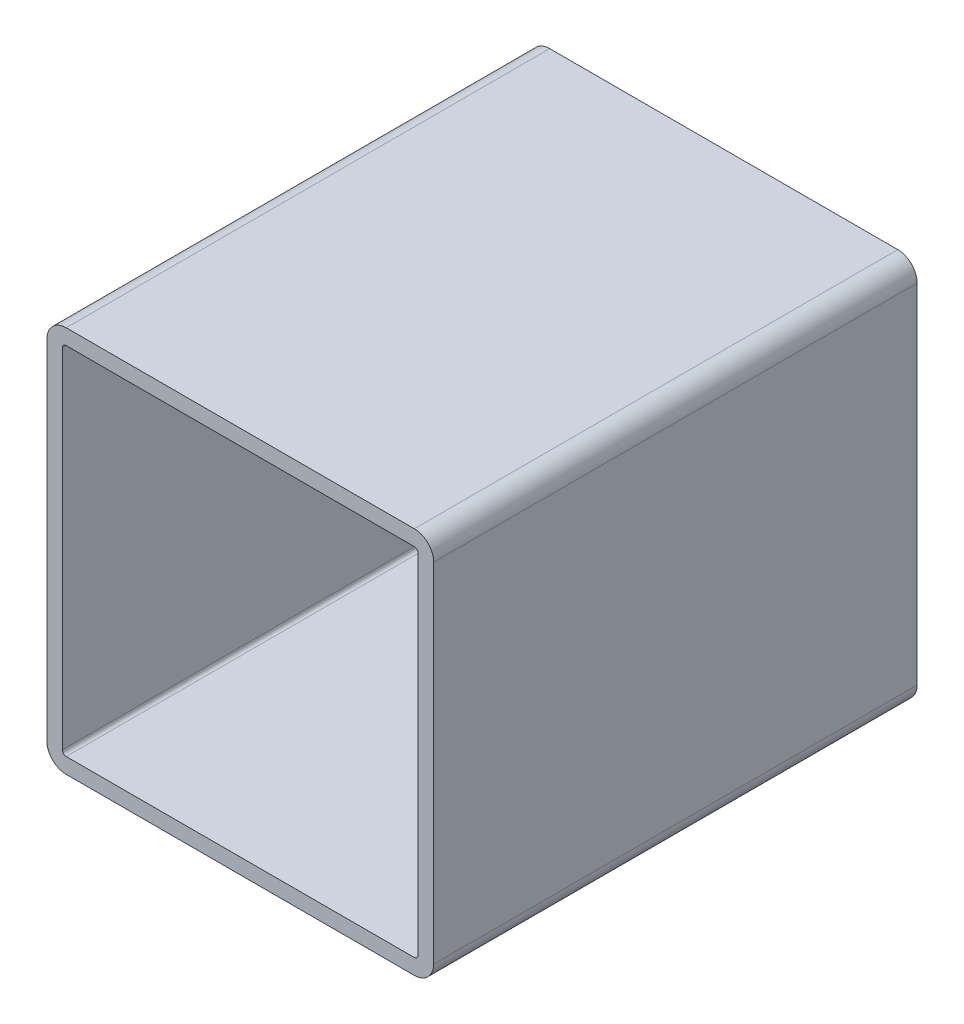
ISO-10303-21;
HEADER;
FILE_DESCRIPTION(('STEP AP214'),'2;1');
FILE_NAME('part.step','',(''),(''),'','','');
FILE_SCHEMA(('AUTOMOTIVE_DESIGN { 1 0 10303 214 1 1 1 1 }'));
ENDSEC;
DATA;
#1=APPLICATION_CONTEXT('core data for automotive mechanical design processes');
#2=APPLICATION_PROTOCOL_DEFINITION('international standard','automotive_design',2000,#1);
#3=PRODUCT_CONTEXT('',#1,'mechanical');
#4=PRODUCT('Part','Part','',(#3));
#5=PRODUCT_RELATED_PRODUCT_CATEGORY('part','',(#4));
#6=PRODUCT_DEFINITION_FORMATION('','',#4);
#7=PRODUCT_DEFINITION_CONTEXT('part definition',#1,'design');
#8=PRODUCT_DEFINITION('design','',#6,#7);
#9=PRODUCT_DEFINITION_SHAPE('','',#8);
#10=(LENGTH_UNIT() NAMED_UNIT(*) SI_UNIT(.MILLI.,.METRE.));
#11=(NAMED_UNIT(*) PLANE_ANGLE_UNIT() SI_UNIT($,.RADIAN.));
#12=(NAMED_UNIT(*) SI_UNIT($,.STERADIAN.) SOLID_ANGLE_UNIT());
#13=UNCERTAINTY_MEASURE_WITH_UNIT(LENGTH_MEASURE(1.E-05),#10,'distance_accuracy_value','');
#14=(GEOMETRIC_REPRESENTATION_CONTEXT(3) GLOBAL_UNCERTAINTY_ASSIGNED_CONTEXT((#13)) GLOBAL_UNIT_ASSIGNED_CONTEXT((#10,
#11,#12)) REPRESENTATION_CONTEXT('',''));
#15=CARTESIAN_POINT('',(0.,0.,0.));
#16=DIRECTION('',(0.,0.,1.));
#17=DIRECTION('',(1.,0.,0.));
#18=AXIS2_PLACEMENT_3D('',#15,#16,#17);
#19=CARTESIAN_POINT('',(95.,-5.,125.));
#20=DIRECTION('',(0.,0.,1.));
#21=DIRECTION('',(1.,0.,0.));
#22=AXIS2_PLACEMENT_3D('',#19,#20,#21);
#23=PLANE('',#22);
#24=CARTESIAN_POINT('',(95.,-5.,125.));
#25=DIRECTION('',(0.,0.,1.));
#26=DIRECTION('',(1.,0.,0.));
#27=AXIS2_PLACEMENT_3D('',#24,#25,#26);
#28=CIRCLE('',#27,5.);
#29=CARTESIAN_POINT('',(100.,-5.00000000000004,125.));
#30=VERTEX_POINT('',#29);
#31=CARTESIAN_POINT('',(95.,0.,125.));
#32=VERTEX_POINT('',#31);
#33=EDGE_CURVE('E227',#30,#32,#28,.T.);
#34=ORIENTED_EDGE('',*,*,#33,.T.);
#35=DIRECTION('',(-1.,0.,0.));
#36=VECTOR('',#35,1.);
#37=CARTESIAN_POINT('',(5.00000000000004,0.,125.));
#38=LINE('',#37,#36);
#39=CARTESIAN_POINT('',(5.00000000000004,0.,125.));
#40=VERTEX_POINT('',#39);
#41=EDGE_CURVE('E230',#32,#40,#38,.T.);
#42=ORIENTED_EDGE('',*,*,#41,.T.);
#43=CARTESIAN_POINT('',(5.,-5.,125.));
#44=DIRECTION('',(0.,0.,1.));
#45=DIRECTION('',(1.,0.,0.));
#46=AXIS2_PLACEMENT_3D('',#43,#44,#45);
#47=CIRCLE('',#46,5.);
#48=CARTESIAN_POINT('',(0.,-5.00000000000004,125.));
#49=VERTEX_POINT('',#48);
#50=EDGE_CURVE('E232',#40,#49,#47,.T.);
#51=ORIENTED_EDGE('',*,*,#50,.T.);
#52=DIRECTION('',(0.,-1.,0.));
#53=VECTOR('',#52,1.);
#54=CARTESIAN_POINT('',(0.,-5.00000000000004,125.));
#55=LINE('',#54,#53);
#56=CARTESIAN_POINT('',(0.,-95.,125.));
#57=VERTEX_POINT('',#56);
#58=EDGE_CURVE('E234',#49,#57,#55,.T.);
#59=ORIENTED_EDGE('',*,*,#58,.T.);
#60=CARTESIAN_POINT('',(5.00000000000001,-95.,125.));
#61=DIRECTION('',(0.,0.,1.));
#62=DIRECTION('',(1.,0.,0.));
#63=AXIS2_PLACEMENT_3D('',#60,#61,#62);
#64=CIRCLE('',#63,5.);
#65=CARTESIAN_POINT('',(5.00000000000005,-100.,125.));
#66=VERTEX_POINT('',#65);
#67=EDGE_CURVE('E236',#57,#66,#64,.T.);
#68=ORIENTED_EDGE('',*,*,#67,.T.);
#69=DIRECTION('',(1.,0.,0.));
#70=VECTOR('',#69,1.);
#71=CARTESIAN_POINT('',(5.00000000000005,-100.,125.));
#72=LINE('',#71,#70);
#73=CARTESIAN_POINT('',(95.,-100.,125.));
#74=VERTEX_POINT('',#73);
#75=EDGE_CURVE('E238',#66,#74,#72,.T.);
#76=ORIENTED_EDGE('',*,*,#75,.T.);
#77=CARTESIAN_POINT('',(95.,-95.,125.));
#78=DIRECTION('',(0.,0.,1.));
#79=DIRECTION('',(-1.,0.,0.));
#80=AXIS2_PLACEMENT_3D('',#77,#78,#79);
#81=CIRCLE('',#80,5.);
#82=CARTESIAN_POINT('',(100.,-95.,125.));
#83=VERTEX_POINT('',#82);
#84=EDGE_CURVE('E240',#74,#83,#81,.T.);
#85=ORIENTED_EDGE('',*,*,#84,.T.);
#86=DIRECTION('',(0.,1.,0.));
#87=VECTOR('',#86,1.);
#88=CARTESIAN_POINT('',(100.,-5.00000000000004,125.));
#89=LINE('',#88,#87);
#90=EDGE_CURVE('E242',#83,#30,#89,.T.);
#91=ORIENTED_EDGE('',*,*,#90,.T.);
#92=EDGE_LOOP('',(#34,#42,#51,#59,#68,#76,#85,#91));
#93=FACE_BOUND('',#92,.T.);
#94=DIRECTION('',(0.,-1.,0.));
#95=VECTOR('',#94,1.);
#96=CARTESIAN_POINT('',(4.,-5.00000000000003,125.));
#97=LINE('',#96,#95);
#98=CARTESIAN_POINT('',(4.,-5.00000000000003,125.));
#99=VERTEX_POINT('',#98);
#100=CARTESIAN_POINT('',(4.00000000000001,-95.,125.));
#101=VERTEX_POINT('',#100);
#102=EDGE_CURVE('E184',#99,#101,#97,.T.);
#103=ORIENTED_EDGE('',*,*,#102,.F.);
#104=CARTESIAN_POINT('',(5.,-5.,125.));
#105=DIRECTION('',(0.,0.,1.));
#106=DIRECTION('',(1.,0.,0.));
#107=AXIS2_PLACEMENT_3D('',#104,#105,#106);
#108=CIRCLE('',#107,0.999999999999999);
#109=CARTESIAN_POINT('',(5.00000000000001,-4.,125.));
#110=VERTEX_POINT('',#109);
#111=EDGE_CURVE('E161',#110,#99,#108,.T.);
#112=ORIENTED_EDGE('',*,*,#111,.F.);
#113=DIRECTION('',(-1.,0.,0.));
#114=VECTOR('',#113,1.);
#115=CARTESIAN_POINT('',(5.00000000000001,-4.,125.));
#116=LINE('',#115,#114);
#117=CARTESIAN_POINT('',(95.,-4.,125.));
#118=VERTEX_POINT('',#117);
#119=EDGE_CURVE('E196',#118,#110,#116,.T.);
#120=ORIENTED_EDGE('',*,*,#119,.F.);
#121=CARTESIAN_POINT('',(95.,-5.,125.));
#122=DIRECTION('',(0.,0.,1.));
#123=DIRECTION('',(1.,0.,0.));
#124=AXIS2_PLACEMENT_3D('',#121,#122,#123);
#125=CIRCLE('',#124,1.);
#126=CARTESIAN_POINT('',(96.,-5.00000000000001,125.));
#127=VERTEX_POINT('',#126);
#128=EDGE_CURVE('E194',#127,#118,#125,.T.);
#129=ORIENTED_EDGE('',*,*,#128,.F.);
#130=DIRECTION('',(0.,1.,0.));
#131=VECTOR('',#130,1.);
#132=CARTESIAN_POINT('',(96.,-5.00000000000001,125.));
#133=LINE('',#132,#131);
#134=CARTESIAN_POINT('',(96.,-95.,125.));
#135=VERTEX_POINT('',#134);
#136=EDGE_CURVE('E192',#135,#127,#133,.T.);
#137=ORIENTED_EDGE('',*,*,#136,.F.);
#138=CARTESIAN_POINT('',(95.,-95.,125.));
#139=DIRECTION('',(0.,0.,1.));
#140=DIRECTION('',(-1.,0.,0.));
#141=AXIS2_PLACEMENT_3D('',#138,#139,#140);
#142=CIRCLE('',#141,1.);
#143=CARTESIAN_POINT('',(95.,-96.,125.));
#144=VERTEX_POINT('',#143);
#145=EDGE_CURVE('E190',#144,#135,#142,.T.);
#146=ORIENTED_EDGE('',*,*,#145,.F.);
#147=DIRECTION('',(1.,0.,0.));
#148=VECTOR('',#147,1.);
#149=CARTESIAN_POINT('',(5.00000000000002,-96.,125.));
#150=LINE('',#149,#148);
#151=CARTESIAN_POINT('',(5.00000000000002,-96.,125.));
#152=VERTEX_POINT('',#151);
#153=EDGE_CURVE('E188',#152,#144,#150,.T.);
#154=ORIENTED_EDGE('',*,*,#153,.F.);
#155=CARTESIAN_POINT('',(5.00000000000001,-95.,125.));
#156=DIRECTION('',(0.,0.,1.));
#157=DIRECTION('',(1.,0.,0.));
#158=AXIS2_PLACEMENT_3D('',#155,#156,#157);
#159=CIRCLE('',#158,1.);
#160=EDGE_CURVE('E186',#101,#152,#159,.T.);
#161=ORIENTED_EDGE('',*,*,#160,.F.);
#162=EDGE_LOOP('',(#103,#112,#120,#129,#137,#146,#154,#161));
#163=FACE_BOUND('',#162,.T.);
#164=ADVANCED_FACE('F33',(#93,#163),#23,.T.);
#165=CARTESIAN_POINT('',(95.,-5.,0.));
#166=DIRECTION('',(0.,0.,1.));
#167=DIRECTION('',(1.,0.,0.));
#168=AXIS2_PLACEMENT_3D('',#165,#166,#167);
#169=PLANE('',#168);
#170=CARTESIAN_POINT('',(95.,-5.,0.));
#171=DIRECTION('',(0.,0.,1.));
#172=DIRECTION('',(1.,0.,0.));
#173=AXIS2_PLACEMENT_3D('',#170,#171,#172);
#174=CIRCLE('',#173,5.);
#175=CARTESIAN_POINT('',(100.,-5.00000000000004,0.));
#176=VERTEX_POINT('',#175);
#177=CARTESIAN_POINT('',(95.,0.,0.));
#178=VERTEX_POINT('',#177);
#179=EDGE_CURVE('E162',#176,#178,#174,.T.);
#180=ORIENTED_EDGE('',*,*,#179,.F.);
#181=DIRECTION('',(0.,1.,0.));
#182=VECTOR('',#181,1.);
#183=CARTESIAN_POINT('',(100.,-5.00000000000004,0.));
#184=LINE('',#183,#182);
#185=CARTESIAN_POINT('',(100.,-95.,0.));
#186=VERTEX_POINT('',#185);
#187=EDGE_CURVE('E225',#186,#176,#184,.T.);
#188=ORIENTED_EDGE('',*,*,#187,.F.);
#189=CARTESIAN_POINT('',(95.,-95.,0.));
#190=DIRECTION('',(0.,0.,1.));
#191=DIRECTION('',(-1.,0.,0.));
#192=AXIS2_PLACEMENT_3D('',#189,#190,#191);
#193=CIRCLE('',#192,5.);
#194=CARTESIAN_POINT('',(95.,-100.,0.));
#195=VERTEX_POINT('',#194);
#196=EDGE_CURVE('E223',#195,#186,#193,.T.);
#197=ORIENTED_EDGE('',*,*,#196,.F.);
#198=DIRECTION('',(1.,0.,0.));
#199=VECTOR('',#198,1.);
#200=CARTESIAN_POINT('',(5.00000000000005,-100.,0.));
#201=LINE('',#200,#199);
#202=CARTESIAN_POINT('',(5.00000000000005,-100.,0.));
#203=VERTEX_POINT('',#202);
#204=EDGE_CURVE('E221',#203,#195,#201,.T.);
#205=ORIENTED_EDGE('',*,*,#204,.F.);
#206=CARTESIAN_POINT('',(5.00000000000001,-95.,0.));
#207=DIRECTION('',(0.,0.,1.));
#208=DIRECTION('',(1.,0.,0.));
#209=AXIS2_PLACEMENT_3D('',#206,#207,#208);
#210=CIRCLE('',#209,5.);
#211=CARTESIAN_POINT('',(0.,-95.,0.));
#212=VERTEX_POINT('',#211);
#213=EDGE_CURVE('E219',#212,#203,#210,.T.);
#214=ORIENTED_EDGE('',*,*,#213,.F.);
#215=DIRECTION('',(0.,-1.,0.));
#216=VECTOR('',#215,1.);
#217=CARTESIAN_POINT('',(0.,-5.00000000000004,0.));
#218=LINE('',#217,#216);
#219=CARTESIAN_POINT('',(0.,-5.00000000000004,0.));
#220=VERTEX_POINT('',#219);
#221=EDGE_CURVE('E217',#220,#212,#218,.T.);
#222=ORIENTED_EDGE('',*,*,#221,.F.);
#223=CARTESIAN_POINT('',(5.,-5.,0.));
#224=DIRECTION('',(0.,0.,1.));
#225=DIRECTION('',(1.,0.,0.));
#226=AXIS2_PLACEMENT_3D('',#223,#224,#225);
#227=CIRCLE('',#226,5.);
#228=CARTESIAN_POINT('',(5.00000000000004,0.,0.));
#229=VERTEX_POINT('',#228);
#230=EDGE_CURVE('E215',#229,#220,#227,.T.);
#231=ORIENTED_EDGE('',*,*,#230,.F.);
#232=DIRECTION('',(-1.,0.,0.));
#233=VECTOR('',#232,1.);
#234=CARTESIAN_POINT('',(5.00000000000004,0.,0.));
#235=LINE('',#234,#233);
#236=EDGE_CURVE('E212',#178,#229,#235,.T.);
#237=ORIENTED_EDGE('',*,*,#236,.F.);
#238=EDGE_LOOP('',(#180,#188,#197,#205,#214,#222,#231,#237));
#239=FACE_BOUND('',#238,.T.);
#240=CARTESIAN_POINT('',(5.,-5.,0.));
#241=DIRECTION('',(0.,0.,1.));
#242=DIRECTION('',(1.,0.,0.));
#243=AXIS2_PLACEMENT_3D('',#240,#241,#242);
#244=CIRCLE('',#243,0.999999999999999);
#245=CARTESIAN_POINT('',(5.,-4.,0.));
#246=VERTEX_POINT('',#245);
#247=CARTESIAN_POINT('',(4.,-5.00000000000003,0.));
#248=VERTEX_POINT('',#247);
#249=EDGE_CURVE('E56',#246,#248,#244,.T.);
#250=ORIENTED_EDGE('',*,*,#249,.T.);
#251=DIRECTION('',(0.,-1.,0.));
#252=VECTOR('',#251,1.);
#253=CARTESIAN_POINT('',(4.,-5.00000000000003,0.));
#254=LINE('',#253,#252);
#255=CARTESIAN_POINT('',(4.00000000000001,-95.,0.));
#256=VERTEX_POINT('',#255);
#257=EDGE_CURVE('E148',#248,#256,#254,.T.);
#258=ORIENTED_EDGE('',*,*,#257,.T.);
#259=CARTESIAN_POINT('',(5.00000000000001,-95.,0.));
#260=DIRECTION('',(0.,0.,1.));
#261=DIRECTION('',(1.,0.,0.));
#262=AXIS2_PLACEMENT_3D('',#259,#260,#261);
#263=CIRCLE('',#262,1.);
#264=CARTESIAN_POINT('',(5.00000000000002,-96.,0.));
#265=VERTEX_POINT('',#264);
#266=EDGE_CURVE('E157',#256,#265,#263,.T.);
#267=ORIENTED_EDGE('',*,*,#266,.T.);
#268=DIRECTION('',(1.,0.,0.));
#269=VECTOR('',#268,1.);
#270=CARTESIAN_POINT('',(5.00000000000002,-96.,0.));
#271=LINE('',#270,#269);
#272=CARTESIAN_POINT('',(95.,-96.,0.));
#273=VERTEX_POINT('',#272);
#274=EDGE_CURVE('E171',#265,#273,#271,.T.);
#275=ORIENTED_EDGE('',*,*,#274,.T.);
#276=CARTESIAN_POINT('',(95.,-95.,0.));
#277=DIRECTION('',(0.,0.,1.));
#278=DIRECTION('',(-1.,0.,0.));
#279=AXIS2_PLACEMENT_3D('',#276,#277,#278);
#280=CIRCLE('',#279,1.);
#281=CARTESIAN_POINT('',(96.,-95.,0.));
#282=VERTEX_POINT('',#281);
#283=EDGE_CURVE('E174',#273,#282,#280,.T.);
#284=ORIENTED_EDGE('',*,*,#283,.T.);
#285=DIRECTION('',(0.,1.,0.));
#286=VECTOR('',#285,1.);
#287=CARTESIAN_POINT('',(96.,-5.00000000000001,0.));
#288=LINE('',#287,#286);
#289=CARTESIAN_POINT('',(96.,-5.00000000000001,0.));
#290=VERTEX_POINT('',#289);
#291=EDGE_CURVE('E177',#282,#290,#288,.T.);
#292=ORIENTED_EDGE('',*,*,#291,.T.);
#293=CARTESIAN_POINT('',(95.,-5.,0.));
#294=DIRECTION('',(0.,0.,1.));
#295=DIRECTION('',(1.,0.,0.));
#296=AXIS2_PLACEMENT_3D('',#293,#294,#295);
#297=CIRCLE('',#296,1.);
#298=CARTESIAN_POINT('',(95.,-4.,0.));
#299=VERTEX_POINT('',#298);
#300=EDGE_CURVE('E180',#290,#299,#297,.T.);
#301=ORIENTED_EDGE('',*,*,#300,.T.);
#302=DIRECTION('',(-1.,0.,0.));
#303=VECTOR('',#302,1.);
#304=CARTESIAN_POINT('',(5.00000000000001,-4.,0.));
#305=LINE('',#304,#303);
#306=EDGE_CURVE('E167',#299,#246,#305,.T.);
#307=ORIENTED_EDGE('',*,*,#306,.T.);
#308=EDGE_LOOP('',(#250,#258,#267,#275,#284,#292,#301,#307));
#309=FACE_BOUND('',#308,.T.);
#310=ADVANCED_FACE('F165',(#239,#309),#169,.F.);
#311=CARTESIAN_POINT('',(95.,-5.,125.));
#312=DIRECTION('',(0.,0.,-1.));
#313=DIRECTION('',(-1.,0.,0.));
#314=AXIS2_PLACEMENT_3D('',#311,#312,#313);
#315=CYLINDRICAL_SURFACE('',#314,5.);
#316=ORIENTED_EDGE('',*,*,#179,.T.);
#317=DIRECTION('',(0.,0.,-1.));
#318=VECTOR('',#317,1.);
#319=CARTESIAN_POINT('',(95.,0.,125.));
#320=LINE('',#319,#318);
#321=EDGE_CURVE('E11',#32,#178,#320,.T.);
#322=ORIENTED_EDGE('',*,*,#321,.F.);
#323=ORIENTED_EDGE('',*,*,#33,.F.);
#324=DIRECTION('',(0.,0.,-1.));
#325=VECTOR('',#324,1.);
#326=CARTESIAN_POINT('',(100.,-5.00000000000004,125.));
#327=LINE('',#326,#325);
#328=EDGE_CURVE('E244',#30,#176,#327,.T.);
#329=ORIENTED_EDGE('',*,*,#328,.T.);
#330=EDGE_LOOP('',(#316,#322,#323,#329));
#331=FACE_BOUND('',#330,.T.);
#332=ADVANCED_FACE('F35',(#331),#315,.T.);
#333=CARTESIAN_POINT('',(5.00000000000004,0.,125.));
#334=DIRECTION('',(0.,-1.,0.));
#335=DIRECTION('',(0.,0.,-1.));
#336=AXIS2_PLACEMENT_3D('',#333,#334,#335);
#337=PLANE('',#336);
#338=ORIENTED_EDGE('',*,*,#236,.T.);
#339=DIRECTION('',(0.,0.,-1.));
#340=VECTOR('',#339,1.);
#341=CARTESIAN_POINT('',(5.00000000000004,0.,125.));
#342=LINE('',#341,#340);
#343=EDGE_CURVE('E41',#40,#229,#342,.T.);
#344=ORIENTED_EDGE('',*,*,#343,.F.);
#345=ORIENTED_EDGE('',*,*,#41,.F.);
#346=ORIENTED_EDGE('',*,*,#321,.T.);
#347=EDGE_LOOP('',(#338,#344,#345,#346));
#348=FACE_BOUND('',#347,.T.);
#349=ADVANCED_FACE('F289',(#348),#337,.F.);
#350=CARTESIAN_POINT('',(5.,-5.,125.));
#351=DIRECTION('',(0.,0.,-1.));
#352=DIRECTION('',(-1.,0.,0.));
#353=AXIS2_PLACEMENT_3D('',#350,#351,#352);
#354=CYLINDRICAL_SURFACE('',#353,5.);
#355=ORIENTED_EDGE('',*,*,#230,.T.);
#356=DIRECTION('',(0.,0.,-1.));
#357=VECTOR('',#356,1.);
#358=CARTESIAN_POINT('',(0.,-5.00000000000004,125.));
#359=LINE('',#358,#357);
#360=EDGE_CURVE('E260',#49,#220,#359,.T.);
#361=ORIENTED_EDGE('',*,*,#360,.F.);
#362=ORIENTED_EDGE('',*,*,#50,.F.);
#363=ORIENTED_EDGE('',*,*,#343,.T.);
#364=EDGE_LOOP('',(#355,#361,#362,#363));
#365=FACE_BOUND('',#364,.T.);
#366=ADVANCED_FACE('F267',(#365),#354,.T.);
#367=CARTESIAN_POINT('',(0.,-5.00000000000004,125.));
#368=DIRECTION('',(1.,0.,0.));
#369=DIRECTION('',(0.,1.,0.));
#370=AXIS2_PLACEMENT_3D('',#367,#368,#369);
#371=PLANE('',#370);
#372=ORIENTED_EDGE('',*,*,#221,.T.);
#373=DIRECTION('',(0.,0.,-1.));
#374=VECTOR('',#373,1.);
#375=CARTESIAN_POINT('',(0.,-95.,125.));
#376=LINE('',#375,#374);
#377=EDGE_CURVE('E257',#57,#212,#376,.T.);
#378=ORIENTED_EDGE('',*,*,#377,.F.);
#379=ORIENTED_EDGE('',*,*,#58,.F.);
#380=ORIENTED_EDGE('',*,*,#360,.T.);
#381=EDGE_LOOP('',(#372,#378,#379,#380));
#382=FACE_BOUND('',#381,.T.);
#383=ADVANCED_FACE('F277',(#382),#371,.F.);
#384=CARTESIAN_POINT('',(5.00000000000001,-95.,125.));
#385=DIRECTION('',(0.,0.,-1.));
#386=DIRECTION('',(-1.,0.,0.));
#387=AXIS2_PLACEMENT_3D('',#384,#385,#386);
#388=CYLINDRICAL_SURFACE('',#387,5.);
#389=ORIENTED_EDGE('',*,*,#213,.T.);
#390=DIRECTION('',(0.,0.,-1.));
#391=VECTOR('',#390,1.);
#392=CARTESIAN_POINT('',(5.00000000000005,-100.,125.));
#393=LINE('',#392,#391);
#394=EDGE_CURVE('E254',#66,#203,#393,.T.);
#395=ORIENTED_EDGE('',*,*,#394,.F.);
#396=ORIENTED_EDGE('',*,*,#67,.F.);
#397=ORIENTED_EDGE('',*,*,#377,.T.);
#398=EDGE_LOOP('',(#389,#395,#396,#397));
#399=FACE_BOUND('',#398,.T.);
#400=ADVANCED_FACE('F281',(#399),#388,.T.);
#401=CARTESIAN_POINT('',(5.00000000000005,-100.,125.));
#402=DIRECTION('',(0.,1.,0.));
#403=DIRECTION('',(0.,0.,1.));
#404=AXIS2_PLACEMENT_3D('',#401,#402,#403);
#405=PLANE('',#404);
#406=ORIENTED_EDGE('',*,*,#204,.T.);
#407=DIRECTION('',(0.,0.,-1.));
#408=VECTOR('',#407,1.);
#409=CARTESIAN_POINT('',(95.,-100.,125.));
#410=LINE('',#409,#408);
#411=EDGE_CURVE('E250',#74,#195,#410,.T.);
#412=ORIENTED_EDGE('',*,*,#411,.F.);
#413=ORIENTED_EDGE('',*,*,#75,.F.);
#414=ORIENTED_EDGE('',*,*,#394,.T.);
#415=EDGE_LOOP('',(#406,#412,#413,#414));
#416=FACE_BOUND('',#415,.T.);
#417=ADVANCED_FACE('F302',(#416),#405,.F.);
#418=CARTESIAN_POINT('',(95.,-95.,125.));
#419=DIRECTION('',(0.,0.,-1.));
#420=DIRECTION('',(-1.,0.,0.));
#421=AXIS2_PLACEMENT_3D('',#418,#419,#420);
#422=CYLINDRICAL_SURFACE('',#421,5.);
#423=ORIENTED_EDGE('',*,*,#196,.T.);
#424=DIRECTION('',(0.,0.,-1.));
#425=VECTOR('',#424,1.);
#426=CARTESIAN_POINT('',(100.,-95.,125.));
#427=LINE('',#426,#425);
#428=EDGE_CURVE('E247',#83,#186,#427,.T.);
#429=ORIENTED_EDGE('',*,*,#428,.F.);
#430=ORIENTED_EDGE('',*,*,#84,.F.);
#431=ORIENTED_EDGE('',*,*,#411,.T.);
#432=EDGE_LOOP('',(#423,#429,#430,#431));
#433=FACE_BOUND('',#432,.T.);
#434=ADVANCED_FACE('F300',(#433),#422,.T.);
#435=CARTESIAN_POINT('',(100.,-5.00000000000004,125.));
#436=DIRECTION('',(-1.,0.,0.));
#437=DIRECTION('',(0.,0.,1.));
#438=AXIS2_PLACEMENT_3D('',#435,#436,#437);
#439=PLANE('',#438);
#440=ORIENTED_EDGE('',*,*,#187,.T.);
#441=ORIENTED_EDGE('',*,*,#328,.F.);
#442=ORIENTED_EDGE('',*,*,#90,.F.);
#443=ORIENTED_EDGE('',*,*,#428,.T.);
#444=EDGE_LOOP('',(#440,#441,#442,#443));
#445=FACE_BOUND('',#444,.T.);
#446=ADVANCED_FACE('F295',(#445),#439,.F.);
#447=CARTESIAN_POINT('',(5.,-5.,125.));
#448=DIRECTION('',(0.,0.,-1.));
#449=DIRECTION('',(-1.,0.,0.));
#450=AXIS2_PLACEMENT_3D('',#447,#448,#449);
#451=CYLINDRICAL_SURFACE('',#450,0.999999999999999);
#452=ORIENTED_EDGE('',*,*,#249,.F.);
#453=DIRECTION('',(0.,0.,-1.));
#454=VECTOR('',#453,1.);
#455=CARTESIAN_POINT('',(5.00000000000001,-4.,125.));
#456=LINE('',#455,#454);
#457=EDGE_CURVE('E198',#110,#246,#456,.T.);
#458=ORIENTED_EDGE('',*,*,#457,.F.);
#459=ORIENTED_EDGE('',*,*,#111,.T.);
#460=DIRECTION('',(0.,0.,-1.));
#461=VECTOR('',#460,1.);
#462=CARTESIAN_POINT('',(4.,-5.00000000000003,125.));
#463=LINE('',#462,#461);
#464=EDGE_CURVE('E150',#99,#248,#463,.T.);
#465=ORIENTED_EDGE('',*,*,#464,.T.);
#466=EDGE_LOOP('',(#452,#458,#459,#465));
#467=FACE_BOUND('',#466,.T.);
#468=ADVANCED_FACE('F159',(#467),#451,.F.);
#469=CARTESIAN_POINT('',(4.,-5.00000000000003,125.));
#470=DIRECTION('',(1.,0.,0.));
#471=DIRECTION('',(0.,1.,0.));
#472=AXIS2_PLACEMENT_3D('',#469,#470,#471);
#473=PLANE('',#472);
#474=ORIENTED_EDGE('',*,*,#257,.F.);
#475=ORIENTED_EDGE('',*,*,#464,.F.);
#476=ORIENTED_EDGE('',*,*,#102,.T.);
#477=DIRECTION('',(0.,0.,-1.));
#478=VECTOR('',#477,1.);
#479=CARTESIAN_POINT('',(4.00000000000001,-95.,125.));
#480=LINE('',#479,#478);
#481=EDGE_CURVE('E153',#101,#256,#480,.T.);
#482=ORIENTED_EDGE('',*,*,#481,.T.);
#483=EDGE_LOOP('',(#474,#475,#476,#482));
#484=FACE_BOUND('',#483,.T.);
#485=ADVANCED_FACE('F149',(#484),#473,.T.);
#486=CARTESIAN_POINT('',(5.00000000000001,-95.,125.));
#487=DIRECTION('',(0.,0.,-1.));
#488=DIRECTION('',(-1.,0.,0.));
#489=AXIS2_PLACEMENT_3D('',#486,#487,#488);
#490=CYLINDRICAL_SURFACE('',#489,1.);
#491=ORIENTED_EDGE('',*,*,#266,.F.);
#492=ORIENTED_EDGE('',*,*,#481,.F.);
#493=ORIENTED_EDGE('',*,*,#160,.T.);
#494=DIRECTION('',(0.,0.,-1.));
#495=VECTOR('',#494,1.);
#496=CARTESIAN_POINT('',(5.00000000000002,-96.,125.));
#497=LINE('',#496,#495);
#498=EDGE_CURVE('E207',#152,#265,#497,.T.);
#499=ORIENTED_EDGE('',*,*,#498,.T.);
#500=EDGE_LOOP('',(#491,#492,#493,#499));
#501=FACE_BOUND('',#500,.T.);
#502=ADVANCED_FACE('F326',(#501),#490,.F.);
#503=CARTESIAN_POINT('',(5.00000000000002,-96.,125.));
#504=DIRECTION('',(0.,1.,0.));
#505=DIRECTION('',(0.,0.,1.));
#506=AXIS2_PLACEMENT_3D('',#503,#504,#505);
#507=PLANE('',#506);
#508=ORIENTED_EDGE('',*,*,#274,.F.);
#509=ORIENTED_EDGE('',*,*,#498,.F.);
#510=ORIENTED_EDGE('',*,*,#153,.T.);
#511=DIRECTION('',(0.,0.,-1.));
#512=VECTOR('',#511,1.);
#513=CARTESIAN_POINT('',(95.,-96.,125.));
#514=LINE('',#513,#512);
#515=EDGE_CURVE('E205',#144,#273,#514,.T.);
#516=ORIENTED_EDGE('',*,*,#515,.T.);
#517=EDGE_LOOP('',(#508,#509,#510,#516));
#518=FACE_BOUND('',#517,.T.);
#519=ADVANCED_FACE('F331',(#518),#507,.T.);
#520=CARTESIAN_POINT('',(95.,-95.,125.));
#521=DIRECTION('',(0.,0.,-1.));
#522=DIRECTION('',(-1.,0.,0.));
#523=AXIS2_PLACEMENT_3D('',#520,#521,#522);
#524=CYLINDRICAL_SURFACE('',#523,1.);
#525=ORIENTED_EDGE('',*,*,#283,.F.);
#526=ORIENTED_EDGE('',*,*,#515,.F.);
#527=ORIENTED_EDGE('',*,*,#145,.T.);
#528=DIRECTION('',(0.,0.,-1.));
#529=VECTOR('',#528,1.);
#530=CARTESIAN_POINT('',(96.,-95.,125.));
#531=LINE('',#530,#529);
#532=EDGE_CURVE('E203',#135,#282,#531,.T.);
#533=ORIENTED_EDGE('',*,*,#532,.T.);
#534=EDGE_LOOP('',(#525,#526,#527,#533));
#535=FACE_BOUND('',#534,.T.);
#536=ADVANCED_FACE('F335',(#535),#524,.F.);
#537=CARTESIAN_POINT('',(96.,-5.00000000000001,125.));
#538=DIRECTION('',(-1.,0.,0.));
#539=DIRECTION('',(0.,0.,1.));
#540=AXIS2_PLACEMENT_3D('',#537,#538,#539);
#541=PLANE('',#540);
#542=ORIENTED_EDGE('',*,*,#291,.F.);
#543=ORIENTED_EDGE('',*,*,#532,.F.);
#544=ORIENTED_EDGE('',*,*,#136,.T.);
#545=DIRECTION('',(0.,0.,-1.));
#546=VECTOR('',#545,1.);
#547=CARTESIAN_POINT('',(96.,-5.00000000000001,125.));
#548=LINE('',#547,#546);
#549=EDGE_CURVE('E201',#127,#290,#548,.T.);
#550=ORIENTED_EDGE('',*,*,#549,.T.);
#551=EDGE_LOOP('',(#542,#543,#544,#550));
#552=FACE_BOUND('',#551,.T.);
#553=ADVANCED_FACE('F339',(#552),#541,.T.);
#554=CARTESIAN_POINT('',(95.,-5.,125.));
#555=DIRECTION('',(0.,0.,-1.));
#556=DIRECTION('',(-1.,0.,0.));
#557=AXIS2_PLACEMENT_3D('',#554,#555,#556);
#558=CYLINDRICAL_SURFACE('',#557,1.);
#559=ORIENTED_EDGE('',*,*,#300,.F.);
#560=ORIENTED_EDGE('',*,*,#549,.F.);
#561=ORIENTED_EDGE('',*,*,#128,.T.);
#562=DIRECTION('',(0.,0.,-1.));
#563=VECTOR('',#562,1.);
#564=CARTESIAN_POINT('',(95.,-4.,125.));
#565=LINE('',#564,#563);
#566=EDGE_CURVE('E48',#118,#299,#565,.T.);
#567=ORIENTED_EDGE('',*,*,#566,.T.);
#568=EDGE_LOOP('',(#559,#560,#561,#567));
#569=FACE_BOUND('',#568,.T.);
#570=ADVANCED_FACE('F343',(#569),#558,.F.);
#571=CARTESIAN_POINT('',(5.00000000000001,-4.,125.));
#572=DIRECTION('',(0.,-1.,0.));
#573=DIRECTION('',(0.,0.,-1.));
#574=AXIS2_PLACEMENT_3D('',#571,#572,#573);
#575=PLANE('',#574);
#576=ORIENTED_EDGE('',*,*,#306,.F.);
#577=ORIENTED_EDGE('',*,*,#566,.F.);
#578=ORIENTED_EDGE('',*,*,#119,.T.);
#579=ORIENTED_EDGE('',*,*,#457,.T.);
#580=EDGE_LOOP('',(#576,#577,#578,#579));
#581=FACE_BOUND('',#580,.T.);
#582=ADVANCED_FACE('F347',(#581),#575,.T.);
#583=CLOSED_SHELL('',(#164,#310,#332,#349,#366,#383,#400,#417,#434,#446,#468,#485,#502,#519,
#536,#553,#570,#582));
#584=MANIFOLD_SOLID_BREP('B2',#583);
#585=ADVANCED_BREP_SHAPE_REPRESENTATION('',(#18,#584),#14);
#586=SHAPE_DEFINITION_REPRESENTATION(#9,#585);
ENDSEC;
END-ISO-10303-21;
